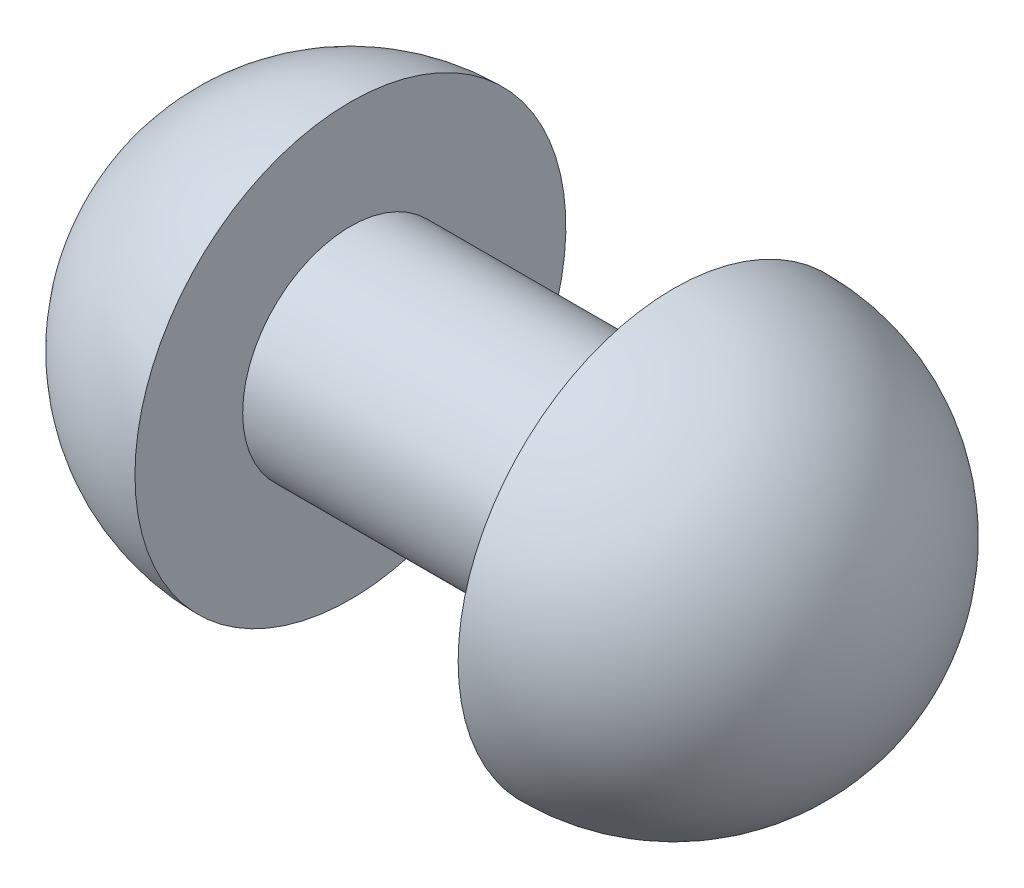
from build123d import *


with BuildPart() as part:
    # Esquisse1 → Base-R_volution (revolve)
    with BuildSketch(Plane.XY):
        with BuildLine():
            Line((0, 4), (0, 2))
            Line((0, 2), (-6, 2))
            Line((-6, 2), (-6, 4))
            ThreePointArc((-6, 4), (-8.828427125, 2.828427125), (-10, 0))
            Line((-10, 0), (4, 0))
            ThreePointArc((4, 0), (2.828427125, 2.828427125), (0, 4))
        make_face()
    revolve(axis=Axis((-14.3, 0, 0), (1, 0, 0)))


solid = part.part
